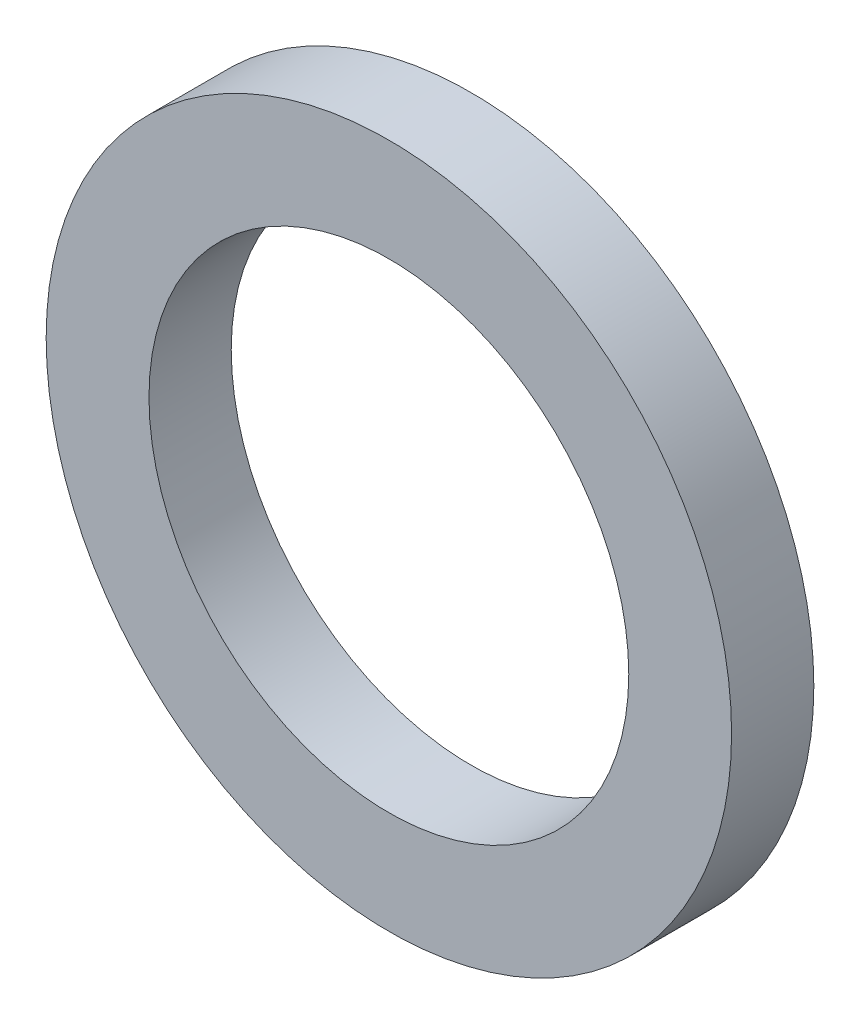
from build123d import *

# Parameters (mm, degrees)
ESQUISSE1_R        = 5
ESQUISSE1_R_2      = 3.5
BOSS_EXTRU_1_DEPTH = 1.2


with BuildPart() as part:
    # Esquisse1 → Boss.-Extru.1 (new body)
    with BuildSketch(Plane.XY):
        Circle(ESQUISSE1_R)
        Circle(ESQUISSE1_R_2, mode=Mode.SUBTRACT)
    extrude(amount=BOSS_EXTRU_1_DEPTH)


solid = part.part
